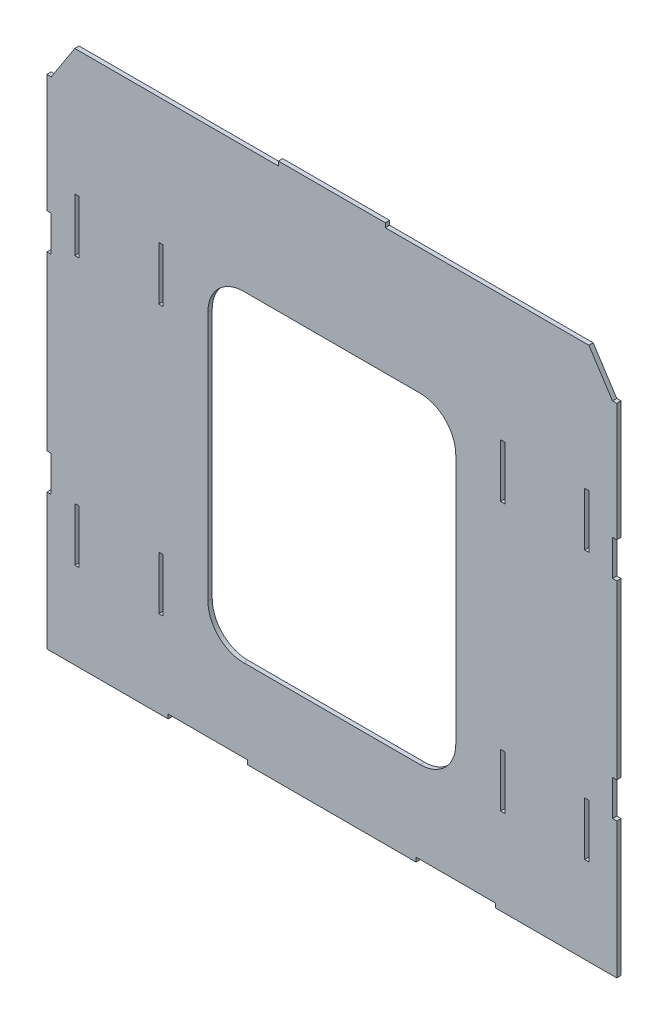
from build123d import *

# Parameters (mm, degrees)
BOSS_EXTRUDE1_DEPTH = 1.524
SKETCH2_W           = 1.524
SKETCH2_H           = 19.05
CUT_EXTRUDE1_DEPTH  = 2.54


with BuildPart() as part:
    # Sketch1 → Boss-Extrude1 (new body)
    with BuildSketch(Plane.XY):
        Polygon((168.71125536, 0), (168.71125536, 1.524), (197.062900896, 1.524), (197.062900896, 0), (257.089099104, 0), (257.089099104, 1.524), (285.44074464, 1.524), (285.44074464, 0), (328.676, 0), (328.676, 48.468836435), (327.152, 48.468836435), (327.152, 61.168836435), (328.676, 61.168836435), (328.676, 122.630588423), (327.152, 122.630588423), (327.152, 135.330588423), (328.676, 135.330588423), (328.676, 177.453164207), (327.152, 177.453164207), (318.720585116, 190.428075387), (246.126, 190.428075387), (246.126, 191.952075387), (208.026, 191.952075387), (208.026, 190.428075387), (135.431414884, 190.428075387), (127, 177.453164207), (125.476, 177.453164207), (125.476, 135.330588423), (127, 135.330588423), (127, 122.630588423), (125.476, 122.630588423), (125.476, 61.168836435), (127, 61.168836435), (127, 48.468836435), (125.476, 48.468836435), (125.476, 0), align=None)
    extrude(amount=BOSS_EXTRUDE1_DEPTH)

    # Sketch2 → Cut-Extrude1 (cut)
    with BuildSketch(Plane.XY.offset(1.524)):
        with BuildLine():
            Line((195.587078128, 30.838686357), (258.564921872, 30.838686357))
            ThreePointArc((258.564921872, 30.838686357), (267.545177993, 34.558430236), (271.264921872, 43.538686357))
            Line((271.264921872, 43.538686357), (271.264921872, 132.813267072))
            ThreePointArc((271.264921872, 132.813267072), (267.545177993, 141.793523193), (258.564921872, 145.513267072))
            Line((258.564921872, 145.513267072), (195.587078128, 145.513267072))
            ThreePointArc((195.587078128, 145.513267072), (186.606822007, 141.793523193), (182.887078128, 132.813267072))
            Line((182.887078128, 132.813267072), (182.887078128, 43.538686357))
            ThreePointArc((182.887078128, 43.538686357), (186.606822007, 34.558430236), (195.587078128, 30.838686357))
        make_face()
        with Locations((166.12172804, 40.363686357)):
            Rectangle(SKETCH2_W, SKETCH2_H)
        with Locations((166.12172804, 135.988267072)):
            Rectangle(SKETCH2_W, SKETCH2_H)
        with Locations((288.03027196, 135.988267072)):
            Rectangle(SKETCH2_W, SKETCH2_H)
        with Locations((288.03027196, 40.363686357)):
            Rectangle(SKETCH2_W, SKETCH2_H)
        with Locations((317.958585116, 135.988267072)):
            Rectangle(SKETCH2_W, SKETCH2_H)
        with Locations((317.958585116, 40.363686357)):
            Rectangle(SKETCH2_W, SKETCH2_H)
        with Locations((136.193414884, 40.363686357)):
            Rectangle(SKETCH2_W, SKETCH2_H)
        with Locations((136.193414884, 135.988267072)):
            Rectangle(SKETCH2_W, SKETCH2_H)
    extrude(amount=-CUT_EXTRUDE1_DEPTH, mode=Mode.SUBTRACT)


solid = part.part
